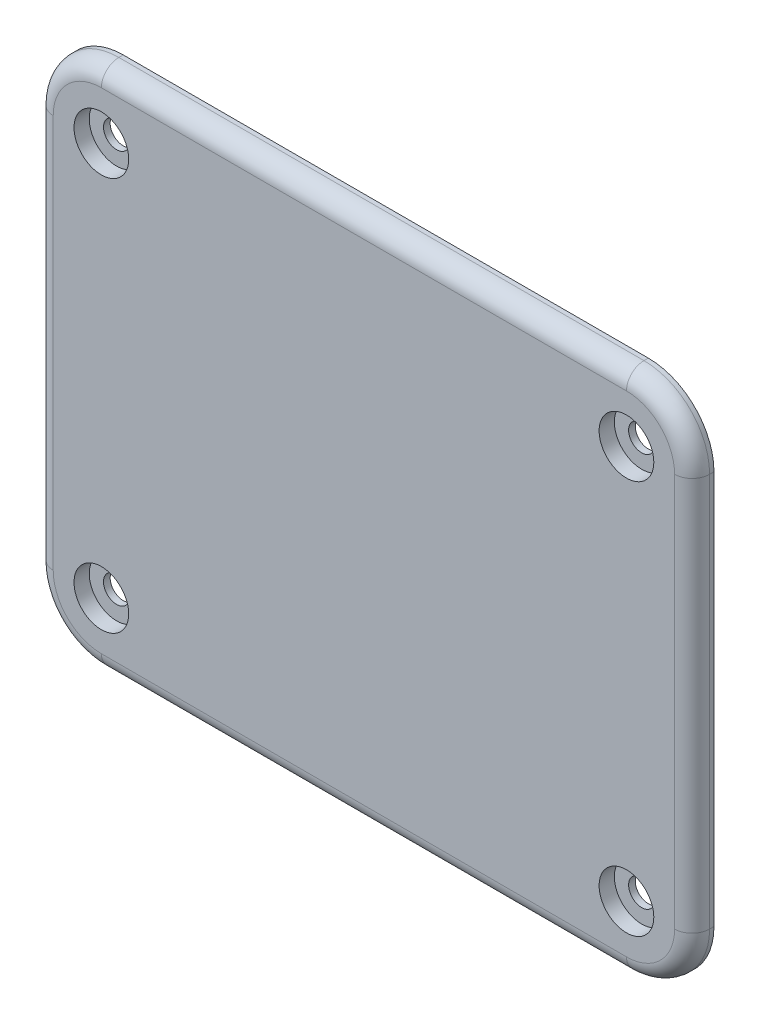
ISO-10303-21;
HEADER;
FILE_DESCRIPTION(('STEP AP214'),'2;1');
FILE_NAME('part.step','',(''),(''),'','','');
FILE_SCHEMA(('AUTOMOTIVE_DESIGN { 1 0 10303 214 1 1 1 1 }'));
ENDSEC;
DATA;
#1=APPLICATION_CONTEXT('core data for automotive mechanical design processes');
#2=APPLICATION_PROTOCOL_DEFINITION('international standard','automotive_design',2000,#1);
#3=PRODUCT_CONTEXT('',#1,'mechanical');
#4=PRODUCT('Part','Part','',(#3));
#5=PRODUCT_RELATED_PRODUCT_CATEGORY('part','',(#4));
#6=PRODUCT_DEFINITION_FORMATION('','',#4);
#7=PRODUCT_DEFINITION_CONTEXT('part definition',#1,'design');
#8=PRODUCT_DEFINITION('design','',#6,#7);
#9=PRODUCT_DEFINITION_SHAPE('','',#8);
#10=(LENGTH_UNIT() NAMED_UNIT(*) SI_UNIT(.MILLI.,.METRE.));
#11=(NAMED_UNIT(*) PLANE_ANGLE_UNIT() SI_UNIT($,.RADIAN.));
#12=(NAMED_UNIT(*) SI_UNIT($,.STERADIAN.) SOLID_ANGLE_UNIT());
#13=UNCERTAINTY_MEASURE_WITH_UNIT(LENGTH_MEASURE(1.E-05),#10,'distance_accuracy_value','');
#14=(GEOMETRIC_REPRESENTATION_CONTEXT(3) GLOBAL_UNCERTAINTY_ASSIGNED_CONTEXT((#13)) GLOBAL_UNIT_ASSIGNED_CONTEXT((#10,
#11,#12)) REPRESENTATION_CONTEXT('',''));
#15=CARTESIAN_POINT('',(0.,0.,0.));
#16=DIRECTION('',(0.,0.,1.));
#17=DIRECTION('',(1.,0.,0.));
#18=AXIS2_PLACEMENT_3D('',#15,#16,#17);
#19=CARTESIAN_POINT('',(38.1,98.425,3.175));
#20=DIRECTION('',(0.,0.,-1.));
#21=DIRECTION('',(-1.,0.,0.));
#22=AXIS2_PLACEMENT_3D('',#19,#20,#21);
#23=CYLINDRICAL_SURFACE('',#22,9.52500000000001);
#24=DIRECTION('',(0.,0.,-1.));
#25=VECTOR('',#24,1.);
#26=CARTESIAN_POINT('',(38.1,107.95,3.175));
#27=LINE('',#26,#25);
#28=CARTESIAN_POINT('',(38.1,107.95,0.635));
#29=VERTEX_POINT('',#28);
#30=CARTESIAN_POINT('',(38.1,107.95,0.));
#31=VERTEX_POINT('',#30);
#32=EDGE_CURVE('E112',#29,#31,#27,.T.);
#33=ORIENTED_EDGE('',*,*,#32,.F.);
#34=CARTESIAN_POINT('',(38.1,98.425,0.635));
#35=DIRECTION('',(0.,0.,1.));
#36=DIRECTION('',(1.,0.,0.));
#37=AXIS2_PLACEMENT_3D('',#34,#35,#36);
#38=CIRCLE('',#37,9.52500000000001);
#39=CARTESIAN_POINT('',(47.625,98.425,0.635));
#40=VERTEX_POINT('',#39);
#41=EDGE_CURVE('E196',#29,#40,#38,.F.);
#42=ORIENTED_EDGE('',*,*,#41,.T.);
#43=DIRECTION('',(0.,0.,-1.));
#44=VECTOR('',#43,1.);
#45=CARTESIAN_POINT('',(47.625,98.425,3.175));
#46=LINE('',#45,#44);
#47=CARTESIAN_POINT('',(47.625,98.425,0.));
#48=VERTEX_POINT('',#47);
#49=EDGE_CURVE('E133',#40,#48,#46,.T.);
#50=ORIENTED_EDGE('',*,*,#49,.T.);
#51=CARTESIAN_POINT('',(38.1,98.425,0.));
#52=DIRECTION('',(0.,0.,1.));
#53=DIRECTION('',(1.,0.,0.));
#54=AXIS2_PLACEMENT_3D('',#51,#52,#53);
#55=CIRCLE('',#54,9.52500000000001);
#56=EDGE_CURVE('E127',#48,#31,#55,.T.);
#57=ORIENTED_EDGE('',*,*,#56,.T.);
#58=EDGE_LOOP('',(#33,#42,#50,#57));
#59=FACE_BOUND('',#58,.T.);
#60=ADVANCED_FACE('F28',(#59),#23,.T.);
#61=CARTESIAN_POINT('',(38.1,107.95,3.175));
#62=DIRECTION('',(0.,-1.,0.));
#63=DIRECTION('',(1.,0.,0.));
#64=AXIS2_PLACEMENT_3D('',#61,#62,#63);
#65=PLANE('',#64);
#66=DIRECTION('',(0.,0.,-1.));
#67=VECTOR('',#66,1.);
#68=CARTESIAN_POINT('',(-38.1,107.95,3.175));
#69=LINE('',#68,#67);
#70=CARTESIAN_POINT('',(-38.1,107.95,0.635));
#71=VERTEX_POINT('',#70);
#72=CARTESIAN_POINT('',(-38.1,107.95,0.));
#73=VERTEX_POINT('',#72);
#74=EDGE_CURVE('E121',#71,#73,#69,.T.);
#75=ORIENTED_EDGE('',*,*,#74,.F.);
#76=DIRECTION('',(-1.,0.,0.));
#77=VECTOR('',#76,1.);
#78=CARTESIAN_POINT('',(38.1,107.95,0.635));
#79=LINE('',#78,#77);
#80=EDGE_CURVE('E11',#71,#29,#79,.F.);
#81=ORIENTED_EDGE('',*,*,#80,.T.);
#82=ORIENTED_EDGE('',*,*,#32,.T.);
#83=DIRECTION('',(-1.,0.,0.));
#84=VECTOR('',#83,1.);
#85=CARTESIAN_POINT('',(38.1,107.95,0.));
#86=LINE('',#85,#84);
#87=EDGE_CURVE('E115',#31,#73,#86,.T.);
#88=ORIENTED_EDGE('',*,*,#87,.T.);
#89=EDGE_LOOP('',(#75,#81,#82,#88));
#90=FACE_BOUND('',#89,.T.);
#91=ADVANCED_FACE('F114',(#90),#65,.F.);
#92=CARTESIAN_POINT('',(-38.1,98.425,3.175));
#93=DIRECTION('',(0.,0.,-1.));
#94=DIRECTION('',(-1.,0.,0.));
#95=AXIS2_PLACEMENT_3D('',#92,#93,#94);
#96=CYLINDRICAL_SURFACE('',#95,9.52500000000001);
#97=DIRECTION('',(0.,0.,-1.));
#98=VECTOR('',#97,1.);
#99=CARTESIAN_POINT('',(-47.625,98.425,3.175));
#100=LINE('',#99,#98);
#101=CARTESIAN_POINT('',(-47.625,98.425,0.635));
#102=VERTEX_POINT('',#101);
#103=CARTESIAN_POINT('',(-47.625,98.425,0.));
#104=VERTEX_POINT('',#103);
#105=EDGE_CURVE('E166',#102,#104,#100,.T.);
#106=ORIENTED_EDGE('',*,*,#105,.F.);
#107=CARTESIAN_POINT('',(-38.1,98.425,0.635));
#108=DIRECTION('',(0.,0.,1.));
#109=DIRECTION('',(1.,0.,0.));
#110=AXIS2_PLACEMENT_3D('',#107,#108,#109);
#111=CIRCLE('',#110,9.52500000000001);
#112=EDGE_CURVE('E35',#102,#71,#111,.F.);
#113=ORIENTED_EDGE('',*,*,#112,.T.);
#114=ORIENTED_EDGE('',*,*,#74,.T.);
#115=CARTESIAN_POINT('',(-38.1,98.425,0.));
#116=DIRECTION('',(0.,0.,1.));
#117=DIRECTION('',(1.,0.,0.));
#118=AXIS2_PLACEMENT_3D('',#115,#116,#117);
#119=CIRCLE('',#118,9.52500000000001);
#120=EDGE_CURVE('E130',#73,#104,#119,.T.);
#121=ORIENTED_EDGE('',*,*,#120,.T.);
#122=EDGE_LOOP('',(#106,#113,#114,#121));
#123=FACE_BOUND('',#122,.T.);
#124=ADVANCED_FACE('F338',(#123),#96,.T.);
#125=CARTESIAN_POINT('',(-47.625,98.425,3.175));
#126=DIRECTION('',(1.,0.,0.));
#127=DIRECTION('',(0.,1.,0.));
#128=AXIS2_PLACEMENT_3D('',#125,#126,#127);
#129=PLANE('',#128);
#130=DIRECTION('',(0.,0.,-1.));
#131=VECTOR('',#130,1.);
#132=CARTESIAN_POINT('',(-47.625,41.275,3.175));
#133=LINE('',#132,#131);
#134=CARTESIAN_POINT('',(-47.625,41.275,0.635));
#135=VERTEX_POINT('',#134);
#136=CARTESIAN_POINT('',(-47.625,41.275,0.));
#137=VERTEX_POINT('',#136);
#138=EDGE_CURVE('E164',#135,#137,#133,.T.);
#139=ORIENTED_EDGE('',*,*,#138,.F.);
#140=DIRECTION('',(0.,-1.,0.));
#141=VECTOR('',#140,1.);
#142=CARTESIAN_POINT('',(-47.625,98.425,0.635));
#143=LINE('',#142,#141);
#144=EDGE_CURVE('E194',#135,#102,#143,.F.);
#145=ORIENTED_EDGE('',*,*,#144,.T.);
#146=ORIENTED_EDGE('',*,*,#105,.T.);
#147=DIRECTION('',(0.,-1.,0.));
#148=VECTOR('',#147,1.);
#149=CARTESIAN_POINT('',(-47.625,98.425,0.));
#150=LINE('',#149,#148);
#151=EDGE_CURVE('E143',#104,#137,#150,.T.);
#152=ORIENTED_EDGE('',*,*,#151,.T.);
#153=EDGE_LOOP('',(#139,#145,#146,#152));
#154=FACE_BOUND('',#153,.T.);
#155=ADVANCED_FACE('F251',(#154),#129,.F.);
#156=CARTESIAN_POINT('',(-38.1,41.275,3.175));
#157=DIRECTION('',(0.,0.,-1.));
#158=DIRECTION('',(-1.,0.,0.));
#159=AXIS2_PLACEMENT_3D('',#156,#157,#158);
#160=CYLINDRICAL_SURFACE('',#159,9.525);
#161=DIRECTION('',(0.,0.,-1.));
#162=VECTOR('',#161,1.);
#163=CARTESIAN_POINT('',(-38.1,31.75,3.175));
#164=LINE('',#163,#162);
#165=CARTESIAN_POINT('',(-38.1,31.75,0.635));
#166=VERTEX_POINT('',#165);
#167=CARTESIAN_POINT('',(-38.1,31.75,0.));
#168=VERTEX_POINT('',#167);
#169=EDGE_CURVE('E162',#166,#168,#164,.T.);
#170=ORIENTED_EDGE('',*,*,#169,.F.);
#171=CARTESIAN_POINT('',(-38.1,41.275,0.635));
#172=DIRECTION('',(0.,0.,1.));
#173=DIRECTION('',(1.,0.,0.));
#174=AXIS2_PLACEMENT_3D('',#171,#172,#173);
#175=CIRCLE('',#174,9.525);
#176=EDGE_CURVE('E190',#166,#135,#175,.F.);
#177=ORIENTED_EDGE('',*,*,#176,.T.);
#178=ORIENTED_EDGE('',*,*,#138,.T.);
#179=CARTESIAN_POINT('',(-38.1,41.275,0.));
#180=DIRECTION('',(0.,0.,1.));
#181=DIRECTION('',(1.,0.,0.));
#182=AXIS2_PLACEMENT_3D('',#179,#180,#181);
#183=CIRCLE('',#182,9.525);
#184=EDGE_CURVE('E146',#137,#168,#183,.T.);
#185=ORIENTED_EDGE('',*,*,#184,.T.);
#186=EDGE_LOOP('',(#170,#177,#178,#185));
#187=FACE_BOUND('',#186,.T.);
#188=ADVANCED_FACE('F248',(#187),#160,.T.);
#189=CARTESIAN_POINT('',(-38.1,31.75,3.175));
#190=DIRECTION('',(0.,1.,0.));
#191=DIRECTION('',(-1.,0.,0.));
#192=AXIS2_PLACEMENT_3D('',#189,#190,#191);
#193=PLANE('',#192);
#194=DIRECTION('',(0.,0.,-1.));
#195=VECTOR('',#194,1.);
#196=CARTESIAN_POINT('',(38.1,31.75,3.175));
#197=LINE('',#196,#195);
#198=CARTESIAN_POINT('',(38.1,31.75,0.635));
#199=VERTEX_POINT('',#198);
#200=CARTESIAN_POINT('',(38.1,31.75,0.));
#201=VERTEX_POINT('',#200);
#202=EDGE_CURVE('E160',#199,#201,#197,.T.);
#203=ORIENTED_EDGE('',*,*,#202,.F.);
#204=DIRECTION('',(1.,0.,0.));
#205=VECTOR('',#204,1.);
#206=CARTESIAN_POINT('',(-38.1,31.75,0.635));
#207=LINE('',#206,#205);
#208=EDGE_CURVE('E185',#199,#166,#207,.F.);
#209=ORIENTED_EDGE('',*,*,#208,.T.);
#210=ORIENTED_EDGE('',*,*,#169,.T.);
#211=DIRECTION('',(1.,0.,0.));
#212=VECTOR('',#211,1.);
#213=CARTESIAN_POINT('',(-38.1,31.75,0.));
#214=LINE('',#213,#212);
#215=EDGE_CURVE('E149',#168,#201,#214,.T.);
#216=ORIENTED_EDGE('',*,*,#215,.T.);
#217=EDGE_LOOP('',(#203,#209,#210,#216));
#218=FACE_BOUND('',#217,.T.);
#219=ADVANCED_FACE('F231',(#218),#193,.F.);
#220=CARTESIAN_POINT('',(38.1,41.275,3.175));
#221=DIRECTION('',(0.,0.,-1.));
#222=DIRECTION('',(-1.,0.,0.));
#223=AXIS2_PLACEMENT_3D('',#220,#221,#222);
#224=CYLINDRICAL_SURFACE('',#223,9.52500000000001);
#225=DIRECTION('',(0.,0.,-1.));
#226=VECTOR('',#225,1.);
#227=CARTESIAN_POINT('',(47.625,41.275,3.175));
#228=LINE('',#227,#226);
#229=CARTESIAN_POINT('',(47.625,41.275,0.635));
#230=VERTEX_POINT('',#229);
#231=CARTESIAN_POINT('',(47.625,41.275,0.));
#232=VERTEX_POINT('',#231);
#233=EDGE_CURVE('E158',#230,#232,#228,.T.);
#234=ORIENTED_EDGE('',*,*,#233,.F.);
#235=CARTESIAN_POINT('',(38.1,41.275,0.635));
#236=DIRECTION('',(0.,0.,1.));
#237=DIRECTION('',(1.,0.,0.));
#238=AXIS2_PLACEMENT_3D('',#235,#236,#237);
#239=CIRCLE('',#238,9.52500000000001);
#240=EDGE_CURVE('E188',#230,#199,#239,.F.);
#241=ORIENTED_EDGE('',*,*,#240,.T.);
#242=ORIENTED_EDGE('',*,*,#202,.T.);
#243=CARTESIAN_POINT('',(38.1,41.275,0.));
#244=DIRECTION('',(0.,0.,1.));
#245=DIRECTION('',(1.,0.,0.));
#246=AXIS2_PLACEMENT_3D('',#243,#244,#245);
#247=CIRCLE('',#246,9.52500000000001);
#248=EDGE_CURVE('E152',#201,#232,#247,.T.);
#249=ORIENTED_EDGE('',*,*,#248,.T.);
#250=EDGE_LOOP('',(#234,#241,#242,#249));
#251=FACE_BOUND('',#250,.T.);
#252=ADVANCED_FACE('F228',(#251),#224,.T.);
#253=CARTESIAN_POINT('',(47.625,41.275,3.175));
#254=DIRECTION('',(-1.,0.,0.));
#255=DIRECTION('',(0.,-1.,0.));
#256=AXIS2_PLACEMENT_3D('',#253,#254,#255);
#257=PLANE('',#256);
#258=ORIENTED_EDGE('',*,*,#49,.F.);
#259=DIRECTION('',(0.,1.,0.));
#260=VECTOR('',#259,1.);
#261=CARTESIAN_POINT('',(47.625,41.275,0.635));
#262=LINE('',#261,#260);
#263=EDGE_CURVE('E192',#40,#230,#262,.F.);
#264=ORIENTED_EDGE('',*,*,#263,.T.);
#265=ORIENTED_EDGE('',*,*,#233,.T.);
#266=DIRECTION('',(0.,1.,0.));
#267=VECTOR('',#266,1.);
#268=CARTESIAN_POINT('',(47.625,41.275,0.));
#269=LINE('',#268,#267);
#270=EDGE_CURVE('E155',#232,#48,#269,.T.);
#271=ORIENTED_EDGE('',*,*,#270,.T.);
#272=EDGE_LOOP('',(#258,#264,#265,#271));
#273=FACE_BOUND('',#272,.T.);
#274=ADVANCED_FACE('F202',(#273),#257,.F.);
#275=CARTESIAN_POINT('',(38.1,98.425,3.175));
#276=DIRECTION('',(0.,0.,1.));
#277=DIRECTION('',(1.,0.,0.));
#278=AXIS2_PLACEMENT_3D('',#275,#276,#277);
#279=PLANE('',#278);
#280=CARTESIAN_POINT('',(-38.1,41.275,3.175));
#281=DIRECTION('',(0.,0.,1.));
#282=DIRECTION('',(1.,0.,0.));
#283=AXIS2_PLACEMENT_3D('',#280,#281,#282);
#284=CIRCLE('',#283,6.985);
#285=CARTESIAN_POINT('',(-45.085,41.275,3.175));
#286=VERTEX_POINT('',#285);
#287=CARTESIAN_POINT('',(-38.1,34.29,3.175));
#288=VERTEX_POINT('',#287);
#289=EDGE_CURVE('E178',#286,#288,#284,.T.);
#290=ORIENTED_EDGE('',*,*,#289,.T.);
#291=DIRECTION('',(1.,0.,0.));
#292=VECTOR('',#291,1.);
#293=CARTESIAN_POINT('',(38.1,34.29,3.175));
#294=LINE('',#293,#292);
#295=CARTESIAN_POINT('',(38.1,34.29,3.175));
#296=VERTEX_POINT('',#295);
#297=EDGE_CURVE('E182',#288,#296,#294,.T.);
#298=ORIENTED_EDGE('',*,*,#297,.T.);
#299=CARTESIAN_POINT('',(38.1,41.275,3.175));
#300=DIRECTION('',(0.,0.,1.));
#301=DIRECTION('',(1.,0.,0.));
#302=AXIS2_PLACEMENT_3D('',#299,#300,#301);
#303=CIRCLE('',#302,6.985);
#304=CARTESIAN_POINT('',(45.085,41.275,3.175));
#305=VERTEX_POINT('',#304);
#306=EDGE_CURVE('E180',#296,#305,#303,.T.);
#307=ORIENTED_EDGE('',*,*,#306,.T.);
#308=DIRECTION('',(0.,1.,0.));
#309=VECTOR('',#308,1.);
#310=CARTESIAN_POINT('',(45.085,98.425,3.175));
#311=LINE('',#310,#309);
#312=CARTESIAN_POINT('',(45.085,98.425,3.175));
#313=VERTEX_POINT('',#312);
#314=EDGE_CURVE('E176',#305,#313,#311,.T.);
#315=ORIENTED_EDGE('',*,*,#314,.T.);
#316=CARTESIAN_POINT('',(38.1,98.425,3.175));
#317=DIRECTION('',(0.,0.,1.));
#318=DIRECTION('',(1.,0.,0.));
#319=AXIS2_PLACEMENT_3D('',#316,#317,#318);
#320=CIRCLE('',#319,6.985);
#321=CARTESIAN_POINT('',(38.1,105.41,3.175));
#322=VERTEX_POINT('',#321);
#323=EDGE_CURVE('E172',#313,#322,#320,.T.);
#324=ORIENTED_EDGE('',*,*,#323,.T.);
#325=DIRECTION('',(-1.,0.,0.));
#326=VECTOR('',#325,1.);
#327=CARTESIAN_POINT('',(-38.1,105.41,3.175));
#328=LINE('',#327,#326);
#329=CARTESIAN_POINT('',(-38.1,105.41,3.175));
#330=VERTEX_POINT('',#329);
#331=EDGE_CURVE('E120',#322,#330,#328,.T.);
#332=ORIENTED_EDGE('',*,*,#331,.T.);
#333=CARTESIAN_POINT('',(-38.1,98.425,3.175));
#334=DIRECTION('',(0.,0.,1.));
#335=DIRECTION('',(1.,0.,0.));
#336=AXIS2_PLACEMENT_3D('',#333,#334,#335);
#337=CIRCLE('',#336,6.985);
#338=CARTESIAN_POINT('',(-45.085,98.425,3.175));
#339=VERTEX_POINT('',#338);
#340=EDGE_CURVE('E170',#330,#339,#337,.T.);
#341=ORIENTED_EDGE('',*,*,#340,.T.);
#342=DIRECTION('',(0.,-1.,0.));
#343=VECTOR('',#342,1.);
#344=CARTESIAN_POINT('',(-45.085,41.275,3.175));
#345=LINE('',#344,#343);
#346=EDGE_CURVE('E174',#339,#286,#345,.T.);
#347=ORIENTED_EDGE('',*,*,#346,.T.);
#348=EDGE_LOOP('',(#290,#298,#307,#315,#324,#332,#341,#347));
#349=FACE_BOUND('',#348,.T.);
#350=CARTESIAN_POINT('',(-38.1,98.425,3.175));
#351=DIRECTION('',(0.,0.,1.));
#352=DIRECTION('',(1.,0.,0.));
#353=AXIS2_PLACEMENT_3D('',#350,#351,#352);
#354=CIRCLE('',#353,3.96875);
#355=CARTESIAN_POINT('',(-34.13125,98.425,3.175));
#356=VERTEX_POINT('',#355);
#357=EDGE_CURVE('E277',#356,#356,#354,.T.);
#358=ORIENTED_EDGE('',*,*,#357,.F.);
#359=EDGE_LOOP('',(#358));
#360=FACE_BOUND('',#359,.T.);
#361=CARTESIAN_POINT('',(38.1,98.425,3.175));
#362=DIRECTION('',(0.,0.,1.));
#363=DIRECTION('',(1.,0.,0.));
#364=AXIS2_PLACEMENT_3D('',#361,#362,#363);
#365=CIRCLE('',#364,3.96875);
#366=CARTESIAN_POINT('',(42.06875,98.425,3.175));
#367=VERTEX_POINT('',#366);
#368=EDGE_CURVE('E289',#367,#367,#365,.T.);
#369=ORIENTED_EDGE('',*,*,#368,.F.);
#370=EDGE_LOOP('',(#369));
#371=FACE_BOUND('',#370,.T.);
#372=CARTESIAN_POINT('',(38.1,41.275,3.175));
#373=DIRECTION('',(0.,0.,1.));
#374=DIRECTION('',(1.,0.,0.));
#375=AXIS2_PLACEMENT_3D('',#372,#373,#374);
#376=CIRCLE('',#375,3.96875);
#377=CARTESIAN_POINT('',(42.06875,41.275,3.175));
#378=VERTEX_POINT('',#377);
#379=EDGE_CURVE('E301',#378,#378,#376,.T.);
#380=ORIENTED_EDGE('',*,*,#379,.F.);
#381=EDGE_LOOP('',(#380));
#382=FACE_BOUND('',#381,.T.);
#383=CARTESIAN_POINT('',(-38.1,41.275,3.175));
#384=DIRECTION('',(0.,0.,1.));
#385=DIRECTION('',(1.,0.,0.));
#386=AXIS2_PLACEMENT_3D('',#383,#384,#385);
#387=CIRCLE('',#386,3.96875);
#388=CARTESIAN_POINT('',(-34.13125,41.275,3.175));
#389=VERTEX_POINT('',#388);
#390=EDGE_CURVE('E135',#389,#389,#387,.T.);
#391=ORIENTED_EDGE('',*,*,#390,.F.);
#392=EDGE_LOOP('',(#391));
#393=FACE_BOUND('',#392,.T.);
#394=ADVANCED_FACE('F320',(#349,#360,#371,#382,#393),#279,.T.);
#395=CARTESIAN_POINT('',(38.1,98.425,0.));
#396=DIRECTION('',(0.,0.,1.));
#397=DIRECTION('',(1.,0.,0.));
#398=AXIS2_PLACEMENT_3D('',#395,#396,#397);
#399=PLANE('',#398);
#400=CARTESIAN_POINT('',(-38.1,98.425,0.));
#401=DIRECTION('',(0.,0.,1.));
#402=DIRECTION('',(1.,0.,0.));
#403=AXIS2_PLACEMENT_3D('',#400,#401,#402);
#404=CIRCLE('',#403,1.89865);
#405=CARTESIAN_POINT('',(-36.20135,98.425,0.));
#406=VERTEX_POINT('',#405);
#407=EDGE_CURVE('E268',#406,#406,#404,.T.);
#408=ORIENTED_EDGE('',*,*,#407,.T.);
#409=EDGE_LOOP('',(#408));
#410=FACE_BOUND('',#409,.T.);
#411=CARTESIAN_POINT('',(38.1,98.425,0.));
#412=DIRECTION('',(0.,0.,1.));
#413=DIRECTION('',(1.,0.,0.));
#414=AXIS2_PLACEMENT_3D('',#411,#412,#413);
#415=CIRCLE('',#414,1.89865);
#416=CARTESIAN_POINT('',(39.99865,98.425,0.));
#417=VERTEX_POINT('',#416);
#418=EDGE_CURVE('E280',#417,#417,#415,.T.);
#419=ORIENTED_EDGE('',*,*,#418,.T.);
#420=EDGE_LOOP('',(#419));
#421=FACE_BOUND('',#420,.T.);
#422=CARTESIAN_POINT('',(38.1,41.275,0.));
#423=DIRECTION('',(0.,0.,1.));
#424=DIRECTION('',(1.,0.,0.));
#425=AXIS2_PLACEMENT_3D('',#422,#423,#424);
#426=CIRCLE('',#425,1.89865);
#427=CARTESIAN_POINT('',(39.99865,41.275,0.));
#428=VERTEX_POINT('',#427);
#429=EDGE_CURVE('E292',#428,#428,#426,.T.);
#430=ORIENTED_EDGE('',*,*,#429,.T.);
#431=EDGE_LOOP('',(#430));
#432=FACE_BOUND('',#431,.T.);
#433=CARTESIAN_POINT('',(-38.1,41.275,0.));
#434=DIRECTION('',(0.,0.,1.));
#435=DIRECTION('',(1.,0.,0.));
#436=AXIS2_PLACEMENT_3D('',#433,#434,#435);
#437=CIRCLE('',#436,1.89865);
#438=CARTESIAN_POINT('',(-36.20135,41.275,0.));
#439=VERTEX_POINT('',#438);
#440=EDGE_CURVE('E304',#439,#439,#437,.T.);
#441=ORIENTED_EDGE('',*,*,#440,.T.);
#442=EDGE_LOOP('',(#441));
#443=FACE_BOUND('',#442,.T.);
#444=ORIENTED_EDGE('',*,*,#56,.F.);
#445=ORIENTED_EDGE('',*,*,#270,.F.);
#446=ORIENTED_EDGE('',*,*,#248,.F.);
#447=ORIENTED_EDGE('',*,*,#215,.F.);
#448=ORIENTED_EDGE('',*,*,#184,.F.);
#449=ORIENTED_EDGE('',*,*,#151,.F.);
#450=ORIENTED_EDGE('',*,*,#120,.F.);
#451=ORIENTED_EDGE('',*,*,#87,.F.);
#452=EDGE_LOOP('',(#444,#445,#446,#447,#448,#449,#450,#451));
#453=FACE_BOUND('',#452,.T.);
#454=ADVANCED_FACE('F125',(#410,#421,#432,#443,#453),#399,.F.);
#455=CARTESIAN_POINT('',(-38.1,41.275,3.175));
#456=DIRECTION('',(0.,0.,1.));
#457=DIRECTION('',(1.,0.,0.));
#458=AXIS2_PLACEMENT_3D('',#455,#456,#457);
#459=CYLINDRICAL_SURFACE('',#458,3.96875);
#460=CARTESIAN_POINT('',(-38.1,41.275,0.9652));
#461=DIRECTION('',(0.,0.,1.));
#462=DIRECTION('',(1.,0.,0.));
#463=AXIS2_PLACEMENT_3D('',#460,#461,#462);
#464=CIRCLE('',#463,3.96875);
#465=CARTESIAN_POINT('',(-34.13125,41.275,0.9652));
#466=VERTEX_POINT('',#465);
#467=EDGE_CURVE('E138',#466,#466,#464,.T.);
#468=ORIENTED_EDGE('',*,*,#467,.F.);
#469=EDGE_LOOP('',(#468));
#470=FACE_BOUND('',#469,.T.);
#471=ORIENTED_EDGE('',*,*,#390,.T.);
#472=EDGE_LOOP('',(#471));
#473=FACE_BOUND('',#472,.T.);
#474=ADVANCED_FACE('F314',(#470,#473),#459,.F.);
#475=CARTESIAN_POINT('',(-36.20135,41.275,0.9652));
#476=DIRECTION('',(0.,0.,-1.));
#477=DIRECTION('',(-1.,0.,0.));
#478=AXIS2_PLACEMENT_3D('',#475,#476,#477);
#479=PLANE('',#478);
#480=CARTESIAN_POINT('',(-38.1,41.275,0.9652));
#481=DIRECTION('',(0.,0.,1.));
#482=DIRECTION('',(1.,0.,0.));
#483=AXIS2_PLACEMENT_3D('',#480,#481,#482);
#484=CIRCLE('',#483,1.89865);
#485=CARTESIAN_POINT('',(-36.20135,41.275,0.9652));
#486=VERTEX_POINT('',#485);
#487=EDGE_CURVE('E307',#486,#486,#484,.T.);
#488=ORIENTED_EDGE('',*,*,#487,.F.);
#489=EDGE_LOOP('',(#488));
#490=FACE_BOUND('',#489,.T.);
#491=ORIENTED_EDGE('',*,*,#467,.T.);
#492=EDGE_LOOP('',(#491));
#493=FACE_BOUND('',#492,.T.);
#494=ADVANCED_FACE('F312',(#490,#493),#479,.F.);
#495=CARTESIAN_POINT('',(-38.1,41.275,3.175));
#496=DIRECTION('',(0.,0.,1.));
#497=DIRECTION('',(1.,0.,0.));
#498=AXIS2_PLACEMENT_3D('',#495,#496,#497);
#499=CYLINDRICAL_SURFACE('',#498,1.89865);
#500=ORIENTED_EDGE('',*,*,#440,.F.);
#501=EDGE_LOOP('',(#500));
#502=FACE_BOUND('',#501,.T.);
#503=ORIENTED_EDGE('',*,*,#487,.T.);
#504=EDGE_LOOP('',(#503));
#505=FACE_BOUND('',#504,.T.);
#506=ADVANCED_FACE('F376',(#502,#505),#499,.F.);
#507=CARTESIAN_POINT('',(38.1,41.275,3.175));
#508=DIRECTION('',(0.,0.,1.));
#509=DIRECTION('',(1.,0.,0.));
#510=AXIS2_PLACEMENT_3D('',#507,#508,#509);
#511=CYLINDRICAL_SURFACE('',#510,3.96875);
#512=CARTESIAN_POINT('',(38.1,41.275,0.9652));
#513=DIRECTION('',(0.,0.,1.));
#514=DIRECTION('',(1.,0.,0.));
#515=AXIS2_PLACEMENT_3D('',#512,#513,#514);
#516=CIRCLE('',#515,3.96875);
#517=CARTESIAN_POINT('',(42.06875,41.275,0.9652));
#518=VERTEX_POINT('',#517);
#519=EDGE_CURVE('E298',#518,#518,#516,.T.);
#520=ORIENTED_EDGE('',*,*,#519,.F.);
#521=EDGE_LOOP('',(#520));
#522=FACE_BOUND('',#521,.T.);
#523=ORIENTED_EDGE('',*,*,#379,.T.);
#524=EDGE_LOOP('',(#523));
#525=FACE_BOUND('',#524,.T.);
#526=ADVANCED_FACE('F384',(#522,#525),#511,.F.);
#527=CARTESIAN_POINT('',(39.99865,41.275,0.9652));
#528=DIRECTION('',(0.,0.,-1.));
#529=DIRECTION('',(-1.,0.,0.));
#530=AXIS2_PLACEMENT_3D('',#527,#528,#529);
#531=PLANE('',#530);
#532=CARTESIAN_POINT('',(38.1,41.275,0.9652));
#533=DIRECTION('',(0.,0.,1.));
#534=DIRECTION('',(1.,0.,0.));
#535=AXIS2_PLACEMENT_3D('',#532,#533,#534);
#536=CIRCLE('',#535,1.89865);
#537=CARTESIAN_POINT('',(39.99865,41.275,0.9652));
#538=VERTEX_POINT('',#537);
#539=EDGE_CURVE('E295',#538,#538,#536,.T.);
#540=ORIENTED_EDGE('',*,*,#539,.F.);
#541=EDGE_LOOP('',(#540));
#542=FACE_BOUND('',#541,.T.);
#543=ORIENTED_EDGE('',*,*,#519,.T.);
#544=EDGE_LOOP('',(#543));
#545=FACE_BOUND('',#544,.T.);
#546=ADVANCED_FACE('F392',(#542,#545),#531,.F.);
#547=CARTESIAN_POINT('',(38.1,41.275,3.175));
#548=DIRECTION('',(0.,0.,1.));
#549=DIRECTION('',(1.,0.,0.));
#550=AXIS2_PLACEMENT_3D('',#547,#548,#549);
#551=CYLINDRICAL_SURFACE('',#550,1.89865);
#552=ORIENTED_EDGE('',*,*,#429,.F.);
#553=EDGE_LOOP('',(#552));
#554=FACE_BOUND('',#553,.T.);
#555=ORIENTED_EDGE('',*,*,#539,.T.);
#556=EDGE_LOOP('',(#555));
#557=FACE_BOUND('',#556,.T.);
#558=ADVANCED_FACE('F400',(#554,#557),#551,.F.);
#559=CARTESIAN_POINT('',(38.1,98.425,3.175));
#560=DIRECTION('',(0.,0.,1.));
#561=DIRECTION('',(1.,0.,0.));
#562=AXIS2_PLACEMENT_3D('',#559,#560,#561);
#563=CYLINDRICAL_SURFACE('',#562,3.96875);
#564=CARTESIAN_POINT('',(38.1,98.425,0.9652));
#565=DIRECTION('',(0.,0.,1.));
#566=DIRECTION('',(1.,0.,0.));
#567=AXIS2_PLACEMENT_3D('',#564,#565,#566);
#568=CIRCLE('',#567,3.96875);
#569=CARTESIAN_POINT('',(42.06875,98.425,0.9652));
#570=VERTEX_POINT('',#569);
#571=EDGE_CURVE('E286',#570,#570,#568,.T.);
#572=ORIENTED_EDGE('',*,*,#571,.F.);
#573=EDGE_LOOP('',(#572));
#574=FACE_BOUND('',#573,.T.);
#575=ORIENTED_EDGE('',*,*,#368,.T.);
#576=EDGE_LOOP('',(#575));
#577=FACE_BOUND('',#576,.T.);
#578=ADVANCED_FACE('F408',(#574,#577),#563,.F.);
#579=CARTESIAN_POINT('',(39.99865,98.425,0.9652));
#580=DIRECTION('',(0.,0.,-1.));
#581=DIRECTION('',(-1.,0.,0.));
#582=AXIS2_PLACEMENT_3D('',#579,#580,#581);
#583=PLANE('',#582);
#584=CARTESIAN_POINT('',(38.1,98.425,0.9652));
#585=DIRECTION('',(0.,0.,1.));
#586=DIRECTION('',(1.,0.,0.));
#587=AXIS2_PLACEMENT_3D('',#584,#585,#586);
#588=CIRCLE('',#587,1.89865);
#589=CARTESIAN_POINT('',(39.99865,98.425,0.9652));
#590=VERTEX_POINT('',#589);
#591=EDGE_CURVE('E283',#590,#590,#588,.T.);
#592=ORIENTED_EDGE('',*,*,#591,.F.);
#593=EDGE_LOOP('',(#592));
#594=FACE_BOUND('',#593,.T.);
#595=ORIENTED_EDGE('',*,*,#571,.T.);
#596=EDGE_LOOP('',(#595));
#597=FACE_BOUND('',#596,.T.);
#598=ADVANCED_FACE('F416',(#594,#597),#583,.F.);
#599=CARTESIAN_POINT('',(38.1,98.425,3.175));
#600=DIRECTION('',(0.,0.,1.));
#601=DIRECTION('',(1.,0.,0.));
#602=AXIS2_PLACEMENT_3D('',#599,#600,#601);
#603=CYLINDRICAL_SURFACE('',#602,1.89865);
#604=ORIENTED_EDGE('',*,*,#418,.F.);
#605=EDGE_LOOP('',(#604));
#606=FACE_BOUND('',#605,.T.);
#607=ORIENTED_EDGE('',*,*,#591,.T.);
#608=EDGE_LOOP('',(#607));
#609=FACE_BOUND('',#608,.T.);
#610=ADVANCED_FACE('F424',(#606,#609),#603,.F.);
#611=CARTESIAN_POINT('',(-38.1,98.425,3.175));
#612=DIRECTION('',(0.,0.,1.));
#613=DIRECTION('',(1.,0.,0.));
#614=AXIS2_PLACEMENT_3D('',#611,#612,#613);
#615=CYLINDRICAL_SURFACE('',#614,3.96875);
#616=CARTESIAN_POINT('',(-38.1,98.425,0.9652));
#617=DIRECTION('',(0.,0.,1.));
#618=DIRECTION('',(1.,0.,0.));
#619=AXIS2_PLACEMENT_3D('',#616,#617,#618);
#620=CIRCLE('',#619,3.96875);
#621=CARTESIAN_POINT('',(-34.13125,98.425,0.9652));
#622=VERTEX_POINT('',#621);
#623=EDGE_CURVE('E274',#622,#622,#620,.T.);
#624=ORIENTED_EDGE('',*,*,#623,.F.);
#625=EDGE_LOOP('',(#624));
#626=FACE_BOUND('',#625,.T.);
#627=ORIENTED_EDGE('',*,*,#357,.T.);
#628=EDGE_LOOP('',(#627));
#629=FACE_BOUND('',#628,.T.);
#630=ADVANCED_FACE('F432',(#626,#629),#615,.F.);
#631=CARTESIAN_POINT('',(-36.20135,98.425,0.9652));
#632=DIRECTION('',(0.,0.,-1.));
#633=DIRECTION('',(-1.,0.,0.));
#634=AXIS2_PLACEMENT_3D('',#631,#632,#633);
#635=PLANE('',#634);
#636=CARTESIAN_POINT('',(-38.1,98.425,0.9652));
#637=DIRECTION('',(0.,0.,1.));
#638=DIRECTION('',(1.,0.,0.));
#639=AXIS2_PLACEMENT_3D('',#636,#637,#638);
#640=CIRCLE('',#639,1.89865);
#641=CARTESIAN_POINT('',(-36.20135,98.425,0.9652));
#642=VERTEX_POINT('',#641);
#643=EDGE_CURVE('E271',#642,#642,#640,.T.);
#644=ORIENTED_EDGE('',*,*,#643,.F.);
#645=EDGE_LOOP('',(#644));
#646=FACE_BOUND('',#645,.T.);
#647=ORIENTED_EDGE('',*,*,#623,.T.);
#648=EDGE_LOOP('',(#647));
#649=FACE_BOUND('',#648,.T.);
#650=ADVANCED_FACE('F440',(#646,#649),#635,.F.);
#651=CARTESIAN_POINT('',(-38.1,98.425,3.175));
#652=DIRECTION('',(0.,0.,1.));
#653=DIRECTION('',(1.,0.,0.));
#654=AXIS2_PLACEMENT_3D('',#651,#652,#653);
#655=CYLINDRICAL_SURFACE('',#654,1.89865);
#656=ORIENTED_EDGE('',*,*,#407,.F.);
#657=EDGE_LOOP('',(#656));
#658=FACE_BOUND('',#657,.T.);
#659=ORIENTED_EDGE('',*,*,#643,.T.);
#660=EDGE_LOOP('',(#659));
#661=FACE_BOUND('',#660,.T.);
#662=ADVANCED_FACE('F448',(#658,#661),#655,.F.);
#663=CARTESIAN_POINT('',(38.1,105.41,0.635));
#664=DIRECTION('',(1.,0.,0.));
#665=DIRECTION('',(0.,1.,0.));
#666=AXIS2_PLACEMENT_3D('',#663,#664,#665);
#667=CYLINDRICAL_SURFACE('',#666,2.54);
#668=CARTESIAN_POINT('',(38.1,105.41,0.635));
#669=DIRECTION('',(1.,0.,0.));
#670=DIRECTION('',(0.,0.,-1.));
#671=AXIS2_PLACEMENT_3D('',#668,#669,#670);
#672=CIRCLE('',#671,2.54);
#673=EDGE_CURVE('E260',#29,#322,#672,.T.);
#674=ORIENTED_EDGE('',*,*,#673,.F.);
#675=ORIENTED_EDGE('',*,*,#80,.F.);
#676=CARTESIAN_POINT('',(-38.1,105.41,0.635));
#677=DIRECTION('',(-1.,0.,0.));
#678=DIRECTION('',(0.,0.,1.));
#679=AXIS2_PLACEMENT_3D('',#676,#677,#678);
#680=CIRCLE('',#679,2.54);
#681=EDGE_CURVE('E262',#330,#71,#680,.T.);
#682=ORIENTED_EDGE('',*,*,#681,.F.);
#683=ORIENTED_EDGE('',*,*,#331,.F.);
#684=EDGE_LOOP('',(#674,#675,#682,#683));
#685=FACE_BOUND('',#684,.T.);
#686=ADVANCED_FACE('F455',(#685),#667,.T.);
#687=CARTESIAN_POINT('',(-38.1,98.425,0.635));
#688=DIRECTION('',(0.,0.,1.));
#689=DIRECTION('',(1.,0.,0.));
#690=AXIS2_PLACEMENT_3D('',#687,#688,#689);
#691=TOROIDAL_SURFACE('',#690,6.985,2.54);
#692=ORIENTED_EDGE('',*,*,#681,.T.);
#693=ORIENTED_EDGE('',*,*,#112,.F.);
#694=CARTESIAN_POINT('',(-45.085,98.425,0.635));
#695=DIRECTION('',(0.,-1.,0.));
#696=DIRECTION('',(0.,0.,-1.));
#697=AXIS2_PLACEMENT_3D('',#694,#695,#696);
#698=CIRCLE('',#697,2.54);
#699=EDGE_CURVE('E211',#339,#102,#698,.T.);
#700=ORIENTED_EDGE('',*,*,#699,.F.);
#701=ORIENTED_EDGE('',*,*,#340,.F.);
#702=EDGE_LOOP('',(#692,#693,#700,#701));
#703=FACE_BOUND('',#702,.T.);
#704=ADVANCED_FACE('F462',(#703),#691,.T.);
#705=CARTESIAN_POINT('',(38.1,98.425,0.635));
#706=DIRECTION('',(0.,0.,1.));
#707=DIRECTION('',(1.,0.,0.));
#708=AXIS2_PLACEMENT_3D('',#705,#706,#707);
#709=TOROIDAL_SURFACE('',#708,6.985,2.54);
#710=ORIENTED_EDGE('',*,*,#673,.T.);
#711=ORIENTED_EDGE('',*,*,#323,.F.);
#712=CARTESIAN_POINT('',(45.085,98.425,0.635));
#713=DIRECTION('',(0.,-1.,0.));
#714=DIRECTION('',(0.,0.,-1.));
#715=AXIS2_PLACEMENT_3D('',#712,#713,#714);
#716=CIRCLE('',#715,2.54);
#717=EDGE_CURVE('E207',#40,#313,#716,.T.);
#718=ORIENTED_EDGE('',*,*,#717,.F.);
#719=ORIENTED_EDGE('',*,*,#41,.F.);
#720=EDGE_LOOP('',(#710,#711,#718,#719));
#721=FACE_BOUND('',#720,.T.);
#722=ADVANCED_FACE('F208',(#721),#709,.T.);
#723=CARTESIAN_POINT('',(-45.085,98.425,0.635));
#724=DIRECTION('',(0.,1.,0.));
#725=DIRECTION('',(-1.,0.,0.));
#726=AXIS2_PLACEMENT_3D('',#723,#724,#725);
#727=CYLINDRICAL_SURFACE('',#726,2.54);
#728=ORIENTED_EDGE('',*,*,#699,.T.);
#729=ORIENTED_EDGE('',*,*,#144,.F.);
#730=CARTESIAN_POINT('',(-45.085,41.275,0.635));
#731=DIRECTION('',(0.,-1.,0.));
#732=DIRECTION('',(1.,0.,0.));
#733=AXIS2_PLACEMENT_3D('',#730,#731,#732);
#734=CIRCLE('',#733,2.54);
#735=EDGE_CURVE('E212',#286,#135,#734,.T.);
#736=ORIENTED_EDGE('',*,*,#735,.F.);
#737=ORIENTED_EDGE('',*,*,#346,.F.);
#738=EDGE_LOOP('',(#728,#729,#736,#737));
#739=FACE_BOUND('',#738,.T.);
#740=ADVANCED_FACE('F255',(#739),#727,.T.);
#741=CARTESIAN_POINT('',(45.085,98.425,0.635));
#742=DIRECTION('',(0.,-1.,0.));
#743=DIRECTION('',(1.,0.,0.));
#744=AXIS2_PLACEMENT_3D('',#741,#742,#743);
#745=CYLINDRICAL_SURFACE('',#744,2.54);
#746=ORIENTED_EDGE('',*,*,#717,.T.);
#747=ORIENTED_EDGE('',*,*,#314,.F.);
#748=CARTESIAN_POINT('',(45.085,41.275,0.635));
#749=DIRECTION('',(0.,-1.,0.));
#750=DIRECTION('',(0.,0.,-1.));
#751=AXIS2_PLACEMENT_3D('',#748,#749,#750);
#752=CIRCLE('',#751,2.54);
#753=EDGE_CURVE('E217',#230,#305,#752,.T.);
#754=ORIENTED_EDGE('',*,*,#753,.F.);
#755=ORIENTED_EDGE('',*,*,#263,.F.);
#756=EDGE_LOOP('',(#746,#747,#754,#755));
#757=FACE_BOUND('',#756,.T.);
#758=ADVANCED_FACE('F215',(#757),#745,.T.);
#759=CARTESIAN_POINT('',(-38.1,41.275,0.635));
#760=DIRECTION('',(0.,0.,1.));
#761=DIRECTION('',(1.,0.,0.));
#762=AXIS2_PLACEMENT_3D('',#759,#760,#761);
#763=TOROIDAL_SURFACE('',#762,6.985,2.54);
#764=ORIENTED_EDGE('',*,*,#735,.T.);
#765=ORIENTED_EDGE('',*,*,#176,.F.);
#766=CARTESIAN_POINT('',(-38.1,34.29,0.635));
#767=DIRECTION('',(1.,0.,0.));
#768=DIRECTION('',(0.,0.,-1.));
#769=AXIS2_PLACEMENT_3D('',#766,#767,#768);
#770=CIRCLE('',#769,2.54);
#771=EDGE_CURVE('E221',#288,#166,#770,.T.);
#772=ORIENTED_EDGE('',*,*,#771,.F.);
#773=ORIENTED_EDGE('',*,*,#289,.F.);
#774=EDGE_LOOP('',(#764,#765,#772,#773));
#775=FACE_BOUND('',#774,.T.);
#776=ADVANCED_FACE('F244',(#775),#763,.T.);
#777=CARTESIAN_POINT('',(38.1,41.275,0.635));
#778=DIRECTION('',(0.,0.,1.));
#779=DIRECTION('',(1.,0.,0.));
#780=AXIS2_PLACEMENT_3D('',#777,#778,#779);
#781=TOROIDAL_SURFACE('',#780,6.985,2.54);
#782=ORIENTED_EDGE('',*,*,#753,.T.);
#783=ORIENTED_EDGE('',*,*,#306,.F.);
#784=CARTESIAN_POINT('',(38.1,34.29,0.635));
#785=DIRECTION('',(-1.,0.,0.));
#786=DIRECTION('',(0.,0.,1.));
#787=AXIS2_PLACEMENT_3D('',#784,#785,#786);
#788=CIRCLE('',#787,2.54);
#789=EDGE_CURVE('E225',#199,#296,#788,.T.);
#790=ORIENTED_EDGE('',*,*,#789,.F.);
#791=ORIENTED_EDGE('',*,*,#240,.F.);
#792=EDGE_LOOP('',(#782,#783,#790,#791));
#793=FACE_BOUND('',#792,.T.);
#794=ADVANCED_FACE('F224',(#793),#781,.T.);
#795=CARTESIAN_POINT('',(38.1,34.29,0.635));
#796=DIRECTION('',(-1.,0.,0.));
#797=DIRECTION('',(0.,-1.,0.));
#798=AXIS2_PLACEMENT_3D('',#795,#796,#797);
#799=CYLINDRICAL_SURFACE('',#798,2.54);
#800=ORIENTED_EDGE('',*,*,#771,.T.);
#801=ORIENTED_EDGE('',*,*,#208,.F.);
#802=ORIENTED_EDGE('',*,*,#789,.T.);
#803=ORIENTED_EDGE('',*,*,#297,.F.);
#804=EDGE_LOOP('',(#800,#801,#802,#803));
#805=FACE_BOUND('',#804,.T.);
#806=ADVANCED_FACE('F236',(#805),#799,.T.);
#807=CLOSED_SHELL('',(#60,#91,#124,#155,#188,#219,#252,#274,#394,#454,#474,#494,#506,#526,#546,
#558,#578,#598,#610,#630,#650,#662,#686,#704,#722,#740,#758,#776,#794,#806));
#808=MANIFOLD_SOLID_BREP('B2',#807);
#809=ADVANCED_BREP_SHAPE_REPRESENTATION('',(#18,#808),#14);
#810=SHAPE_DEFINITION_REPRESENTATION(#9,#809);
ENDSEC;
END-ISO-10303-21;
